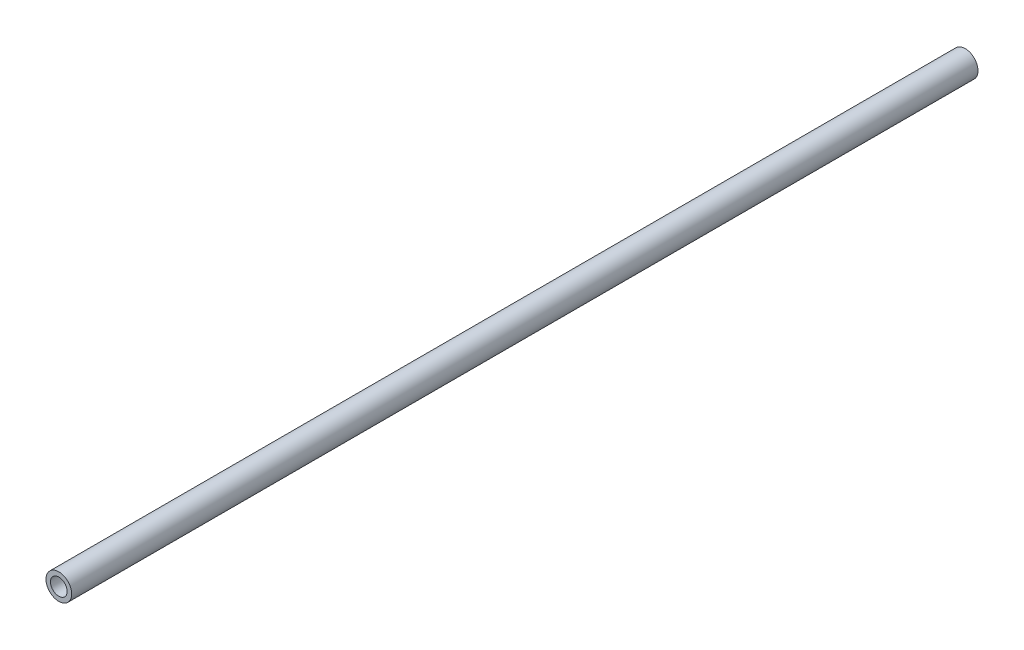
from build123d import *

# Parameters (mm, degrees)
ESQUISSE1_R      = 1
ESQUISSE1_R_2    = 0.65
EXTRUSION1_DEPTH = 70.6


with BuildPart() as part:
    # Esquisse1 → Extrusion1 (new body)
    with BuildSketch(Plane.XY):
        Circle(ESQUISSE1_R)
        Circle(ESQUISSE1_R_2, mode=Mode.SUBTRACT)
    extrude(amount=EXTRUSION1_DEPTH)


solid = part.part
